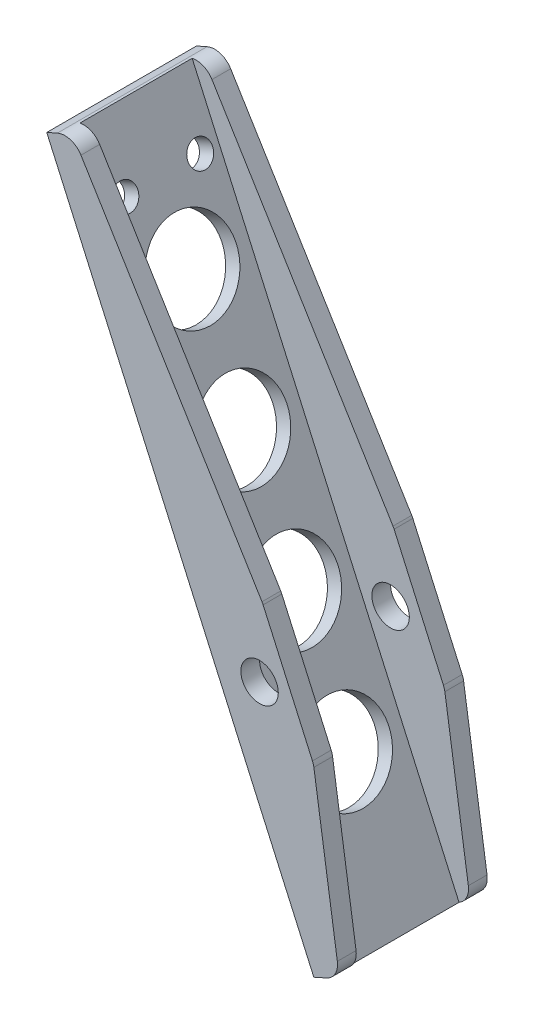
from build123d import *

# Parameters (mm, degrees)
ESQUISSE1_R             = 3.000000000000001
BOSS_EXTRU_1_DEPTH      = 3
BOSS_EXTRU_2_DEPTH      = 18
ESQUISSE4_R             = 3.0000000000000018
BOSS_EXTRU_3_DEPTH      = 3
CONG_1_R                = 3
ESQUISSE8_R             = 2.0000000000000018
ESQUISSE8_R_2           = 2.0000000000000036
ENL_V_MAT_EXTRU_1_DEPTH = 4
CONG_2_R                = 3
ENL_V_MAT_EXTRU_2_DEPTH = 103.74467621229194
CONG_3_R                = 3
ESQUISSE10_R            = 7.046252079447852
ENL_V_MAT_EXTRU_3_DEPTH = 20


with BuildPart() as part:
    # Esquisse1 → Boss.-Extru.1 (new body)
    with BuildSketch(Plane.XY.offset(-3.00000000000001)):
        Polygon((8.695260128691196, -5.909633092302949), (-34.11892264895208, 89.9650025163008), (-23.16182143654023, 94.8580519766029), (19.65236134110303, -1.0165836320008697), align=None)
        with Locations((0, 30.729041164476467)):
            Circle(ESQUISSE1_R, mode=Mode.SUBTRACT)
    extrude(amount=-BOSS_EXTRU_1_DEPTH)

    # Esquisse3 → Boss.-Extru.2 (add)
    with BuildSketch(Plane(origin=(0, 0, -6.000000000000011), x_dir=(-1, 0, 0), z_dir=(0, 0, -1))):
        Polygon((34.11892264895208, 89.9650025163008), (-8.695260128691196, -5.909633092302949), (-10.97798954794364, -4.890247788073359), (31.83619322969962, 90.98438782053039), align=None)
    extrude(amount=BOSS_EXTRU_2_DEPTH)

    # Esquisse4 → Boss.-Extru.3 (add)
    with BuildSketch(Plane(origin=(0, 0, -24.000000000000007), x_dir=(-1, 0, 0), z_dir=(0, 0, -1))):
        Polygon((-19.65236134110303, -1.0165836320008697), (-8.695260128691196, -5.909633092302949), (34.11892264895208, 89.9650025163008), (23.16182143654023, 94.8580519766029), align=None)
        with Locations(Location((0, 30.729041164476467, 0), (0, 0, 180))):
            Circle(ESQUISSE4_R, mode=Mode.SUBTRACT)
    extrude(amount=BOSS_EXTRU_3_DEPTH)

    # Cong_1
    cong_1_edges = [part.edges().sort_by_distance(p)[0] for p in [
        (19.65236134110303, -1.0165836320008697, -25.500000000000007),
        (19.65236134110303, -1.0165836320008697, -4.500000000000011),
    ]]
    fillet(cong_1_edges, radius=CONG_1_R)

    # Esquisse8 → Enl_v. mat.-Extru.1 (cut)
    with BuildSketch(Plane(origin=(5.049299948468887, 2.2548367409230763, 0), x_dir=(0, 0, 1), z_dir=(-0.9130917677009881, -0.4077541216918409, 0))):
        with Locations(Location((-8.999999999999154, 85.46726569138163, 0), (0, 0, 270))):
            Circle(ESQUISSE8_R)
        with Locations(Location((-20.999999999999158, 85.46726569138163, 0), (0, 0, 270))):
            Circle(ESQUISSE8_R_2)
    extrude(amount=-ENL_V_MAT_EXTRU_1_DEPTH, mode=Mode.SUBTRACT)

    # Cong_2
    cong_2_edges = [part.edges().sort_by_distance(p)[0] for p in [
        (-23.16182143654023, 94.8580519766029, -25.500000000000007),
        (-23.16182143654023, 94.8580519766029, -4.500000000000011),
    ]]
    fillet(cong_2_edges, radius=CONG_2_R)

    # Esquisse9 → Enl_v. mat.-Extru.2 (cut, through all)
    with BuildSketch(Plane.XY.offset(-3.00000000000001)):
        with BuildLine():
            Line((0.4879176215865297, 41.898729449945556), (-30.01000969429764, 91.79989606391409))
            Line((-30.01000969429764, 91.79989606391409), (-25.9010967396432, 93.63478961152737))
            ThreePointArc((-25.9010967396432, 93.63478961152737), (-23.605851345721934, 93.69745156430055), (-21.938559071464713, 92.11877667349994))
            Line((-21.938559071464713, 92.11877667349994), (0.4879176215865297, 41.898729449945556))
        make_face()
        with BuildLine():
            Line((8.643000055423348, 23.636894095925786), (12.804173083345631, -4.07473954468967))
            Line((12.804173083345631, -4.07473954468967), (16.91308603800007, -2.239845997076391))
            ThreePointArc((16.91308603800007, -2.239845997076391), (18.49176092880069, -0.5725537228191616), (18.429098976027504, 1.7226916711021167))
            Line((18.429098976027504, 1.7226916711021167), (8.643000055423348, 23.636894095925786))
        make_face()
    extrude(amount=-ENL_V_MAT_EXTRU_2_DEPTH, mode=Mode.SUBTRACT)

    # Cong_3
    cong_3_edges = [part.edges().sort_by_distance(p)[0] for p in [
        (-30.01000969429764, 91.79989606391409, -25.500000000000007),
        (0.4879176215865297, 41.898729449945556, -4.500000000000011),
        (0.4879176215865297, 41.898729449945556, -25.500000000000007),
        (8.643000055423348, 23.636894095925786, -4.500000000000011),
        (8.643000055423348, 23.636894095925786, -25.500000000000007),
        (12.804173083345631, -4.07473954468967, -25.500000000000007),
    ]]
    fillet(cong_3_edges, radius=CONG_3_R)

    # Esquisse10 → Enl_v. mat.-Extru.3 (cut)
    with BuildSketch(Plane(origin=(5.049299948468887, 2.2548367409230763, 0), x_dir=(0, 0, 1), z_dir=(-0.9130917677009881, -0.4077541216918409, 0))):
        with Locations(Location((-15.000000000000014, 73.81711128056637, 0), (0, 0, 270))):
            Circle(ESQUISSE10_R)
        with Locations(Location((-14.999999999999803, 53.817111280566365, 0), (0, 0, 270))):
            Circle(ESQUISSE10_R)
        with Locations(Location((-14.999999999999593, 33.817111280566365, 0), (0, 0, 270))):
            Circle(ESQUISSE10_R)
        with Locations(Location((-14.999999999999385, 13.817111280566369, 0), (0, 0, 270))):
            Circle(ESQUISSE10_R)
    extrude(amount=-ENL_V_MAT_EXTRU_3_DEPTH, mode=Mode.SUBTRACT)


solid = part.part
